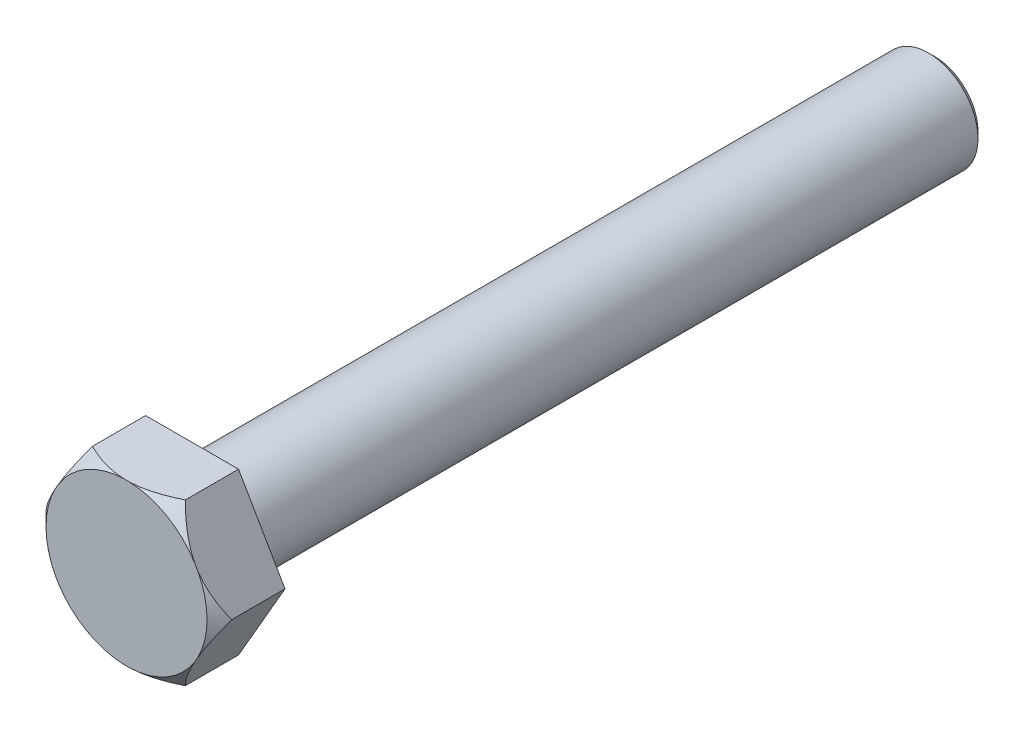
from build123d import *

# Parameters (mm, degrees)
BOSS_EXTRU_1_DEPTH = 5.3


with BuildPart() as part:
    # Esquisse1 → Boss.-Extru.1 (new body)
    with BuildSketch(Plane.XY):
        Polygon((7.505553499, 0), (3.75277675, 6.5), (-3.75277675, 6.5), (-7.505553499, 0), (-3.75277675, -6.5), (3.75277675, -6.5), align=None)
    extrude(amount=BOSS_EXTRU_1_DEPTH)

    # Esquisse3 → Enl_vement de mati_re-R_volution2 (revolve, cut)
    with BuildSketch(Plane(origin=(0, 0, 0), x_dir=(1, 0, 0), z_dir=(0, 1, 0))):
        Polygon((-7.505553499, -4.3), (-6.505553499, -5.3), (-6.505553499, -6.142860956), (-9.024896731, -6.142860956), (-9.024896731, -4.3), align=None)
    revolve(axis=Axis((0, 0, -2.903094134), (0, 0, 1)), mode=Mode.SUBTRACT)


with BuildPart() as body_2:
    # Esquisse4 → R_volution2 (revolve)
    with BuildSketch(Plane(origin=(0, 0, 0), x_dir=(0, 0, -1), z_dir=(1, 0, 0)), mode=Mode.PRIVATE) as r_volution2_sk:
        Polygon((0, -4), (59.5, -4), (60, -3.5), (60, 0), (0, 0), align=None)
    revolve(r_volution2_sk.sketch.rotate(Axis((0, 0, 0), (0, 0, -1)), 270), axis=Axis((0, 0, 0), (0, 0, -1)))


solid = Compound([part.part, body_2.part])
